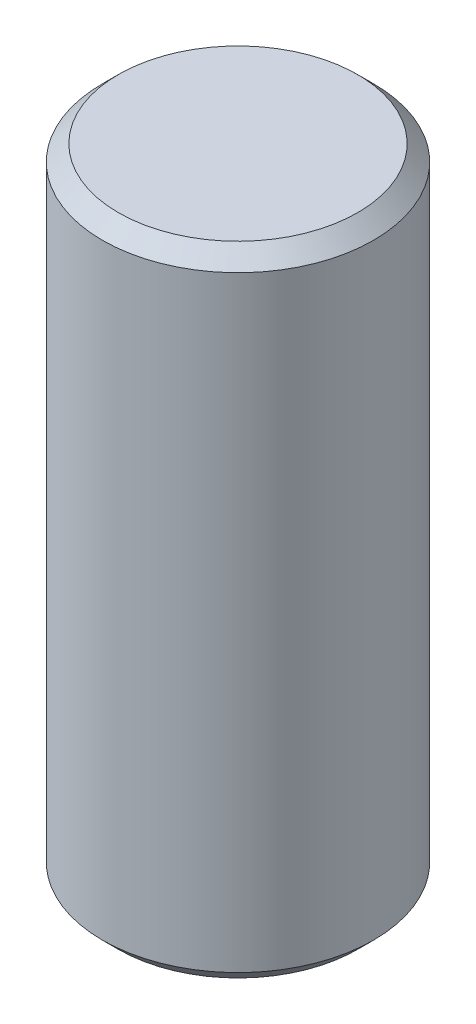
ISO-10303-21;
HEADER;
FILE_DESCRIPTION(('STEP AP214'),'2;1');
FILE_NAME('part.step','',(''),(''),'','','');
FILE_SCHEMA(('AUTOMOTIVE_DESIGN { 1 0 10303 214 1 1 1 1 }'));
ENDSEC;
DATA;
#1=APPLICATION_CONTEXT('core data for automotive mechanical design processes');
#2=APPLICATION_PROTOCOL_DEFINITION('international standard','automotive_design',2000,#1);
#3=PRODUCT_CONTEXT('',#1,'mechanical');
#4=PRODUCT('Part','Part','',(#3));
#5=PRODUCT_RELATED_PRODUCT_CATEGORY('part','',(#4));
#6=PRODUCT_DEFINITION_FORMATION('','',#4);
#7=PRODUCT_DEFINITION_CONTEXT('part definition',#1,'design');
#8=PRODUCT_DEFINITION('design','',#6,#7);
#9=PRODUCT_DEFINITION_SHAPE('','',#8);
#10=(LENGTH_UNIT() NAMED_UNIT(*) SI_UNIT(.MILLI.,.METRE.));
#11=(NAMED_UNIT(*) PLANE_ANGLE_UNIT() SI_UNIT($,.RADIAN.));
#12=(NAMED_UNIT(*) SI_UNIT($,.STERADIAN.) SOLID_ANGLE_UNIT());
#13=UNCERTAINTY_MEASURE_WITH_UNIT(LENGTH_MEASURE(1.E-05),#10,'distance_accuracy_value','');
#14=(GEOMETRIC_REPRESENTATION_CONTEXT(3) GLOBAL_UNCERTAINTY_ASSIGNED_CONTEXT((#13)) GLOBAL_UNIT_ASSIGNED_CONTEXT((#10,
#11,#12)) REPRESENTATION_CONTEXT('',''));
#15=CARTESIAN_POINT('',(0.,0.,0.));
#16=DIRECTION('',(0.,0.,1.));
#17=DIRECTION('',(1.,0.,0.));
#18=AXIS2_PLACEMENT_3D('',#15,#16,#17);
#19=CARTESIAN_POINT('',(0.,6.,0.));
#20=DIRECTION('',(0.,-1.,0.));
#21=DIRECTION('',(0.,0.,-1.));
#22=AXIS2_PLACEMENT_3D('',#19,#20,#21);
#23=CYLINDRICAL_SURFACE('',#22,2.55);
#24=CARTESIAN_POINT('',(0.,-5.7,0.));
#25=DIRECTION('',(0.,1.,0.));
#26=DIRECTION('',(0.,0.,1.));
#27=AXIS2_PLACEMENT_3D('',#24,#25,#26);
#28=CIRCLE('',#27,2.55);
#29=CARTESIAN_POINT('',(0.,-5.7,2.55));
#30=VERTEX_POINT('',#29);
#31=EDGE_CURVE('E42',#30,#30,#28,.T.);
#32=ORIENTED_EDGE('',*,*,#31,.T.);
#33=EDGE_LOOP('',(#32));
#34=FACE_BOUND('',#33,.T.);
#35=CARTESIAN_POINT('',(0.,5.7,0.));
#36=DIRECTION('',(0.,1.,0.));
#37=DIRECTION('',(0.,0.,1.));
#38=AXIS2_PLACEMENT_3D('',#35,#36,#37);
#39=CIRCLE('',#38,2.55);
#40=CARTESIAN_POINT('',(0.,5.7,2.55));
#41=VERTEX_POINT('',#40);
#42=EDGE_CURVE('E46',#41,#41,#39,.F.);
#43=ORIENTED_EDGE('',*,*,#42,.T.);
#44=EDGE_LOOP('',(#43));
#45=FACE_BOUND('',#44,.T.);
#46=ADVANCED_FACE('F31',(#34,#45),#23,.T.);
#47=CARTESIAN_POINT('',(0.,6.,0.));
#48=DIRECTION('',(0.,1.,0.));
#49=DIRECTION('',(0.,0.,1.));
#50=AXIS2_PLACEMENT_3D('',#47,#48,#49);
#51=PLANE('',#50);
#52=CARTESIAN_POINT('',(0.,6.,0.));
#53=DIRECTION('',(0.,1.,0.));
#54=DIRECTION('',(0.,0.,1.));
#55=AXIS2_PLACEMENT_3D('',#52,#53,#54);
#56=CIRCLE('',#55,2.25);
#57=CARTESIAN_POINT('',(0.,6.,2.25));
#58=VERTEX_POINT('',#57);
#59=EDGE_CURVE('E10',#58,#58,#56,.T.);
#60=ORIENTED_EDGE('',*,*,#59,.T.);
#61=EDGE_LOOP('',(#60));
#62=FACE_BOUND('',#61,.T.);
#63=ADVANCED_FACE('F62',(#62),#51,.T.);
#64=CARTESIAN_POINT('',(0.,-6.,0.));
#65=DIRECTION('',(0.,1.,0.));
#66=DIRECTION('',(0.,0.,1.));
#67=AXIS2_PLACEMENT_3D('',#64,#65,#66);
#68=PLANE('',#67);
#69=CARTESIAN_POINT('',(0.,-6.,0.));
#70=DIRECTION('',(0.,1.,0.));
#71=DIRECTION('',(0.,0.,1.));
#72=AXIS2_PLACEMENT_3D('',#69,#70,#71);
#73=CIRCLE('',#72,2.25);
#74=CARTESIAN_POINT('',(0.,-6.,2.25));
#75=VERTEX_POINT('',#74);
#76=EDGE_CURVE('E38',#75,#75,#73,.F.);
#77=ORIENTED_EDGE('',*,*,#76,.T.);
#78=EDGE_LOOP('',(#77));
#79=FACE_BOUND('',#78,.T.);
#80=ADVANCED_FACE('F59',(#79),#68,.F.);
#81=CARTESIAN_POINT('',(0.,-5.7,0.));
#82=DIRECTION('',(0.,1.,0.));
#83=DIRECTION('',(0.,0.,1.));
#84=AXIS2_PLACEMENT_3D('',#81,#82,#83);
#85=CONICAL_SURFACE('',#84,2.55,0.785398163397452);
#86=ORIENTED_EDGE('',*,*,#76,.F.);
#87=EDGE_LOOP('',(#86));
#88=FACE_BOUND('',#87,.T.);
#89=ORIENTED_EDGE('',*,*,#31,.F.);
#90=EDGE_LOOP('',(#89));
#91=FACE_BOUND('',#90,.T.);
#92=ADVANCED_FACE('F55',(#88,#91),#85,.T.);
#93=CARTESIAN_POINT('',(0.,6.,0.));
#94=DIRECTION('',(0.,-1.,0.));
#95=DIRECTION('',(0.,0.,-1.));
#96=AXIS2_PLACEMENT_3D('',#93,#94,#95);
#97=CONICAL_SURFACE('',#96,2.25,0.785398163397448);
#98=ORIENTED_EDGE('',*,*,#42,.F.);
#99=EDGE_LOOP('',(#98));
#100=FACE_BOUND('',#99,.T.);
#101=ORIENTED_EDGE('',*,*,#59,.F.);
#102=EDGE_LOOP('',(#101));
#103=FACE_BOUND('',#102,.T.);
#104=ADVANCED_FACE('F33',(#100,#103),#97,.T.);
#105=CLOSED_SHELL('',(#46,#63,#80,#92,#104));
#106=MANIFOLD_SOLID_BREP('B2',#105);
#107=ADVANCED_BREP_SHAPE_REPRESENTATION('',(#18,#106),#14);
#108=SHAPE_DEFINITION_REPRESENTATION(#9,#107);
ENDSEC;
END-ISO-10303-21;
